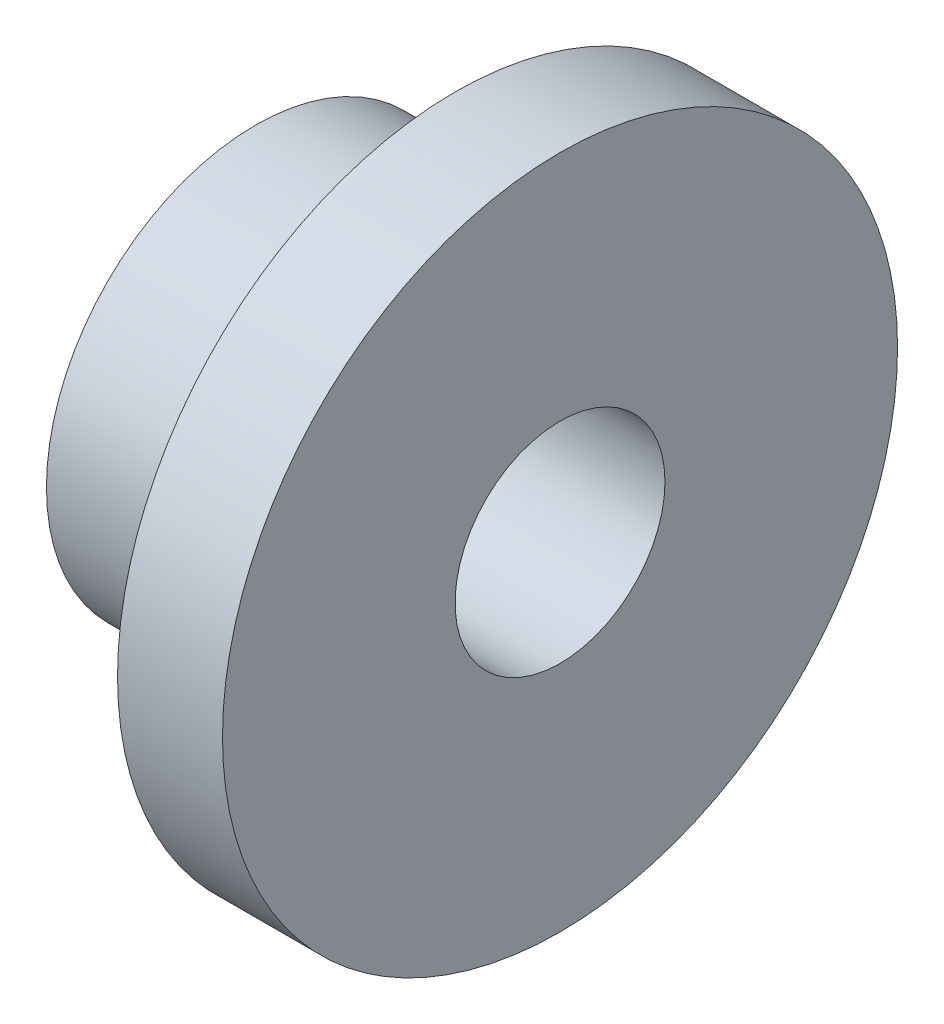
ISO-10303-21;
HEADER;
FILE_DESCRIPTION(('STEP AP214'),'2;1');
FILE_NAME('part.step','',(''),(''),'','','');
FILE_SCHEMA(('AUTOMOTIVE_DESIGN { 1 0 10303 214 1 1 1 1 }'));
ENDSEC;
DATA;
#1=APPLICATION_CONTEXT('core data for automotive mechanical design processes');
#2=APPLICATION_PROTOCOL_DEFINITION('international standard','automotive_design',2000,#1);
#3=PRODUCT_CONTEXT('',#1,'mechanical');
#4=PRODUCT('Part','Part','',(#3));
#5=PRODUCT_RELATED_PRODUCT_CATEGORY('part','',(#4));
#6=PRODUCT_DEFINITION_FORMATION('','',#4);
#7=PRODUCT_DEFINITION_CONTEXT('part definition',#1,'design');
#8=PRODUCT_DEFINITION('design','',#6,#7);
#9=PRODUCT_DEFINITION_SHAPE('','',#8);
#10=(LENGTH_UNIT() NAMED_UNIT(*) SI_UNIT(.MILLI.,.METRE.));
#11=(NAMED_UNIT(*) PLANE_ANGLE_UNIT() SI_UNIT($,.RADIAN.));
#12=(NAMED_UNIT(*) SI_UNIT($,.STERADIAN.) SOLID_ANGLE_UNIT());
#13=UNCERTAINTY_MEASURE_WITH_UNIT(LENGTH_MEASURE(1.E-05),#10,'distance_accuracy_value','');
#14=(GEOMETRIC_REPRESENTATION_CONTEXT(3) GLOBAL_UNCERTAINTY_ASSIGNED_CONTEXT((#13)) GLOBAL_UNIT_ASSIGNED_CONTEXT((#10,
#11,#12)) REPRESENTATION_CONTEXT('',''));
#15=CARTESIAN_POINT('',(0.,0.,0.));
#16=DIRECTION('',(0.,0.,1.));
#17=DIRECTION('',(1.,0.,0.));
#18=AXIS2_PLACEMENT_3D('',#15,#16,#17);
#19=CARTESIAN_POINT('',(22.5,-50.,8.7420219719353));
#20=DIRECTION('',(1.,0.,0.));
#21=DIRECTION('',(0.,0.,-1.));
#22=AXIS2_PLACEMENT_3D('',#19,#20,#21);
#23=PLANE('',#22);
#24=CARTESIAN_POINT('',(22.5,0.,28.));
#25=DIRECTION('',(1.,0.,0.));
#26=DIRECTION('',(0.,0.,-1.));
#27=AXIS2_PLACEMENT_3D('',#24,#25,#26);
#28=CIRCLE('',#27,19.9273838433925);
#29=CARTESIAN_POINT('',(22.5,0.,8.0726161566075));
#30=VERTEX_POINT('',#29);
#31=EDGE_CURVE('E49',#30,#30,#28,.T.);
#32=ORIENTED_EDGE('',*,*,#31,.F.);
#33=EDGE_LOOP('',(#32));
#34=FACE_BOUND('',#33,.T.);
#35=CARTESIAN_POINT('',(22.5,0.,28.));
#36=DIRECTION('',(1.,0.,0.));
#37=DIRECTION('',(0.,0.,-1.));
#38=AXIS2_PLACEMENT_3D('',#35,#36,#37);
#39=CIRCLE('',#38,10.);
#40=CARTESIAN_POINT('',(22.5,0.,18.));
#41=VERTEX_POINT('',#40);
#42=EDGE_CURVE('E10',#41,#41,#39,.F.);
#43=ORIENTED_EDGE('',*,*,#42,.F.);
#44=EDGE_LOOP('',(#43));
#45=FACE_BOUND('',#44,.T.);
#46=ADVANCED_FACE('F43',(#34,#45),#23,.F.);
#47=CARTESIAN_POINT('',(51.5,0.,28.));
#48=DIRECTION('',(-1.,0.,0.));
#49=DIRECTION('',(0.,0.,1.));
#50=AXIS2_PLACEMENT_3D('',#47,#48,#49);
#51=CYLINDRICAL_SURFACE('',#50,32.1556925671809);
#52=CARTESIAN_POINT('',(51.5,0.,28.));
#53=DIRECTION('',(1.,0.,0.));
#54=DIRECTION('',(0.,0.,-1.));
#55=AXIS2_PLACEMENT_3D('',#52,#53,#54);
#56=CIRCLE('',#55,32.1556925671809);
#57=CARTESIAN_POINT('',(51.5,0.,-4.15569256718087));
#58=VERTEX_POINT('',#57);
#59=EDGE_CURVE('E57',#58,#58,#56,.T.);
#60=ORIENTED_EDGE('',*,*,#59,.F.);
#61=EDGE_LOOP('',(#60));
#62=FACE_BOUND('',#61,.T.);
#63=CARTESIAN_POINT('',(41.5,0.,28.));
#64=DIRECTION('',(1.,0.,0.));
#65=DIRECTION('',(0.,0.,-1.));
#66=AXIS2_PLACEMENT_3D('',#63,#64,#65);
#67=CIRCLE('',#66,32.1556925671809);
#68=CARTESIAN_POINT('',(41.5,0.,-4.15569256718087));
#69=VERTEX_POINT('',#68);
#70=EDGE_CURVE('E60',#69,#69,#67,.T.);
#71=ORIENTED_EDGE('',*,*,#70,.T.);
#72=EDGE_LOOP('',(#71));
#73=FACE_BOUND('',#72,.T.);
#74=ADVANCED_FACE('F88',(#62,#73),#51,.T.);
#75=CARTESIAN_POINT('',(41.5,0.,28.));
#76=DIRECTION('',(1.,0.,0.));
#77=DIRECTION('',(0.,0.,-1.));
#78=AXIS2_PLACEMENT_3D('',#75,#76,#77);
#79=PLANE('',#78);
#80=CARTESIAN_POINT('',(41.5,0.,28.));
#81=DIRECTION('',(1.,0.,0.));
#82=DIRECTION('',(0.,0.,-1.));
#83=AXIS2_PLACEMENT_3D('',#80,#81,#82);
#84=CIRCLE('',#83,19.9273838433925);
#85=CARTESIAN_POINT('',(41.5,0.,8.0726161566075));
#86=VERTEX_POINT('',#85);
#87=EDGE_CURVE('E53',#86,#86,#84,.T.);
#88=ORIENTED_EDGE('',*,*,#87,.T.);
#89=EDGE_LOOP('',(#88));
#90=FACE_BOUND('',#89,.T.);
#91=ORIENTED_EDGE('',*,*,#70,.F.);
#92=EDGE_LOOP('',(#91));
#93=FACE_BOUND('',#92,.T.);
#94=ADVANCED_FACE('F83',(#90,#93),#79,.F.);
#95=CARTESIAN_POINT('',(41.5,0.,28.));
#96=DIRECTION('',(-1.,0.,0.));
#97=DIRECTION('',(0.,0.,1.));
#98=AXIS2_PLACEMENT_3D('',#95,#96,#97);
#99=CYLINDRICAL_SURFACE('',#98,19.9273838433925);
#100=ORIENTED_EDGE('',*,*,#87,.F.);
#101=EDGE_LOOP('',(#100));
#102=FACE_BOUND('',#101,.T.);
#103=ORIENTED_EDGE('',*,*,#31,.T.);
#104=EDGE_LOOP('',(#103));
#105=FACE_BOUND('',#104,.T.);
#106=ADVANCED_FACE('F73',(#102,#105),#99,.T.);
#107=CARTESIAN_POINT('',(51.5,0.,28.));
#108=DIRECTION('',(1.,0.,0.));
#109=DIRECTION('',(0.,0.,-1.));
#110=AXIS2_PLACEMENT_3D('',#107,#108,#109);
#111=PLANE('',#110);
#112=ORIENTED_EDGE('',*,*,#59,.T.);
#113=EDGE_LOOP('',(#112));
#114=FACE_BOUND('',#113,.T.);
#115=CARTESIAN_POINT('',(51.5,0.,28.));
#116=DIRECTION('',(1.,0.,0.));
#117=DIRECTION('',(0.,0.,-1.));
#118=AXIS2_PLACEMENT_3D('',#115,#116,#117);
#119=CIRCLE('',#118,10.);
#120=CARTESIAN_POINT('',(51.5,0.,18.));
#121=VERTEX_POINT('',#120);
#122=EDGE_CURVE('E63',#121,#121,#119,.T.);
#123=ORIENTED_EDGE('',*,*,#122,.F.);
#124=EDGE_LOOP('',(#123));
#125=FACE_BOUND('',#124,.T.);
#126=ADVANCED_FACE('F71',(#114,#125),#111,.T.);
#127=CARTESIAN_POINT('',(0.,0.,28.));
#128=DIRECTION('',(1.,0.,0.));
#129=DIRECTION('',(0.,0.,-1.));
#130=AXIS2_PLACEMENT_3D('',#127,#128,#129);
#131=CYLINDRICAL_SURFACE('',#130,10.);
#132=CARTESIAN_POINT('',(22.5,0.,18.));
#133=CARTESIAN_POINT('',(22.8020833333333,0.,18.));
#134=CARTESIAN_POINT('',(23.1041666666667,0.,18.));
#135=CARTESIAN_POINT('',(23.7083333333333,0.,18.));
#136=CARTESIAN_POINT('',(24.0104166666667,0.,18.));
#137=CARTESIAN_POINT('',(24.6145833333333,0.,18.));
#138=CARTESIAN_POINT('',(24.9166666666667,0.,18.));
#139=CARTESIAN_POINT('',(25.5208333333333,0.,18.));
#140=CARTESIAN_POINT('',(25.8229166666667,0.,18.));
#141=CARTESIAN_POINT('',(26.4270833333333,0.,18.));
#142=CARTESIAN_POINT('',(26.7291666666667,0.,18.));
#143=CARTESIAN_POINT('',(27.3333333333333,0.,18.));
#144=CARTESIAN_POINT('',(27.6354166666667,0.,18.));
#145=CARTESIAN_POINT('',(28.2395833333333,0.,18.));
#146=CARTESIAN_POINT('',(28.5416666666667,0.,18.));
#147=CARTESIAN_POINT('',(29.1458333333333,0.,18.));
#148=CARTESIAN_POINT('',(29.4479166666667,0.,18.));
#149=CARTESIAN_POINT('',(30.0520833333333,0.,18.));
#150=CARTESIAN_POINT('',(30.3541666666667,0.,18.));
#151=CARTESIAN_POINT('',(30.9583333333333,0.,18.));
#152=CARTESIAN_POINT('',(31.2604166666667,0.,18.));
#153=CARTESIAN_POINT('',(31.8645833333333,0.,18.));
#154=CARTESIAN_POINT('',(32.1666666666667,0.,18.));
#155=CARTESIAN_POINT('',(32.7708333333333,0.,18.));
#156=CARTESIAN_POINT('',(33.0729166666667,0.,18.));
#157=CARTESIAN_POINT('',(33.6770833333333,0.,18.));
#158=CARTESIAN_POINT('',(33.9791666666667,0.,18.));
#159=CARTESIAN_POINT('',(34.5833333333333,0.,18.));
#160=CARTESIAN_POINT('',(34.8854166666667,0.,18.));
#161=CARTESIAN_POINT('',(35.4895833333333,0.,18.));
#162=CARTESIAN_POINT('',(35.7916666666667,0.,18.));
#163=CARTESIAN_POINT('',(36.3958333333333,0.,18.));
#164=CARTESIAN_POINT('',(36.6979166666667,0.,18.));
#165=CARTESIAN_POINT('',(37.3020833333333,0.,18.));
#166=CARTESIAN_POINT('',(37.6041666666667,0.,18.));
#167=CARTESIAN_POINT('',(38.2083333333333,0.,18.));
#168=CARTESIAN_POINT('',(38.5104166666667,0.,18.));
#169=CARTESIAN_POINT('',(39.1145833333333,0.,18.));
#170=CARTESIAN_POINT('',(39.4166666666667,0.,18.));
#171=CARTESIAN_POINT('',(40.0208333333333,0.,18.));
#172=CARTESIAN_POINT('',(40.3229166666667,0.,18.));
#173=CARTESIAN_POINT('',(40.9270833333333,0.,18.));
#174=CARTESIAN_POINT('',(41.2291666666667,0.,18.));
#175=CARTESIAN_POINT('',(41.8333333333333,0.,18.));
#176=CARTESIAN_POINT('',(42.1354166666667,0.,18.));
#177=CARTESIAN_POINT('',(42.7395833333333,0.,18.));
#178=CARTESIAN_POINT('',(43.0416666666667,0.,18.));
#179=CARTESIAN_POINT('',(43.6458333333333,0.,18.));
#180=CARTESIAN_POINT('',(43.9479166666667,0.,18.));
#181=CARTESIAN_POINT('',(44.5520833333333,0.,18.));
#182=CARTESIAN_POINT('',(44.8541666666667,0.,18.));
#183=CARTESIAN_POINT('',(45.4583333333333,0.,18.));
#184=CARTESIAN_POINT('',(45.7604166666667,0.,18.));
#185=CARTESIAN_POINT('',(46.3645833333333,0.,18.));
#186=CARTESIAN_POINT('',(46.6666666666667,0.,18.));
#187=CARTESIAN_POINT('',(47.2708333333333,0.,18.));
#188=CARTESIAN_POINT('',(47.5729166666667,0.,18.));
#189=CARTESIAN_POINT('',(48.1770833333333,0.,18.));
#190=CARTESIAN_POINT('',(48.4791666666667,0.,18.));
#191=CARTESIAN_POINT('',(49.0833333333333,0.,18.));
#192=CARTESIAN_POINT('',(49.3854166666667,0.,18.));
#193=CARTESIAN_POINT('',(49.9895833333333,0.,18.));
#194=CARTESIAN_POINT('',(50.2916666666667,0.,18.));
#195=CARTESIAN_POINT('',(50.8958333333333,0.,18.));
#196=CARTESIAN_POINT('',(51.1979166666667,0.,18.));
#197=CARTESIAN_POINT('',(51.5,0.,18.));
#198=B_SPLINE_CURVE_WITH_KNOTS('',3,(#132,#133,#134,#135,#136,#137,#138,#139,#140,#141,#142,
#143,#144,#145,#146,#147,#148,#149,#150,#151,#152,#153,#154,#155,#156,#157,#158,#159,#160,#161,
#162,#163,#164,#165,#166,#167,#168,#169,#170,#171,#172,#173,#174,#175,#176,#177,#178,#179,#180,
#181,#182,#183,#184,#185,#186,#187,#188,#189,#190,#191,#192,#193,#194,#195,#196,#197),
.UNSPECIFIED.,.F.,.F.,(4,2,2,2,2,2,2,2,2,2,2,2,2,2,2,2,2,2,2,2,2,2,2,2,2,2,2,2,2,2,2,2,4),(0.,
0.906250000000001,1.8125,2.71875,3.625,4.53125,5.4375,6.34375,7.25,8.15625,9.0625,9.96875,
10.875,11.78125,12.6875,13.59375,14.5,15.40625,16.3125,17.21875,18.125,19.03125,19.9375,
20.84375,21.75,22.65625,23.5625,24.46875,25.375,26.28125,27.1875,28.09375,29.),.UNSPECIFIED.);
#199=EDGE_CURVE('BSEAM69',#41,#121,#198,.T.);
#200=ORIENTED_EDGE('',*,*,#42,.T.);
#201=ORIENTED_EDGE('',*,*,#122,.T.);
#202=ORIENTED_EDGE('',*,*,#199,.T.);
#203=ORIENTED_EDGE('',*,*,#199,.F.);
#204=EDGE_LOOP('',(#200,#202,#201,#203));
#205=FACE_BOUND('',#204,.T.);
#206=ADVANCED_FACE('F69',(#205),#131,.F.);
#207=CLOSED_SHELL('',(#46,#74,#94,#106,#126,#206));
#208=MANIFOLD_SOLID_BREP('B2',#207);
#209=ADVANCED_BREP_SHAPE_REPRESENTATION('',(#18,#208),#14);
#210=SHAPE_DEFINITION_REPRESENTATION(#9,#209);
ENDSEC;
END-ISO-10303-21;
